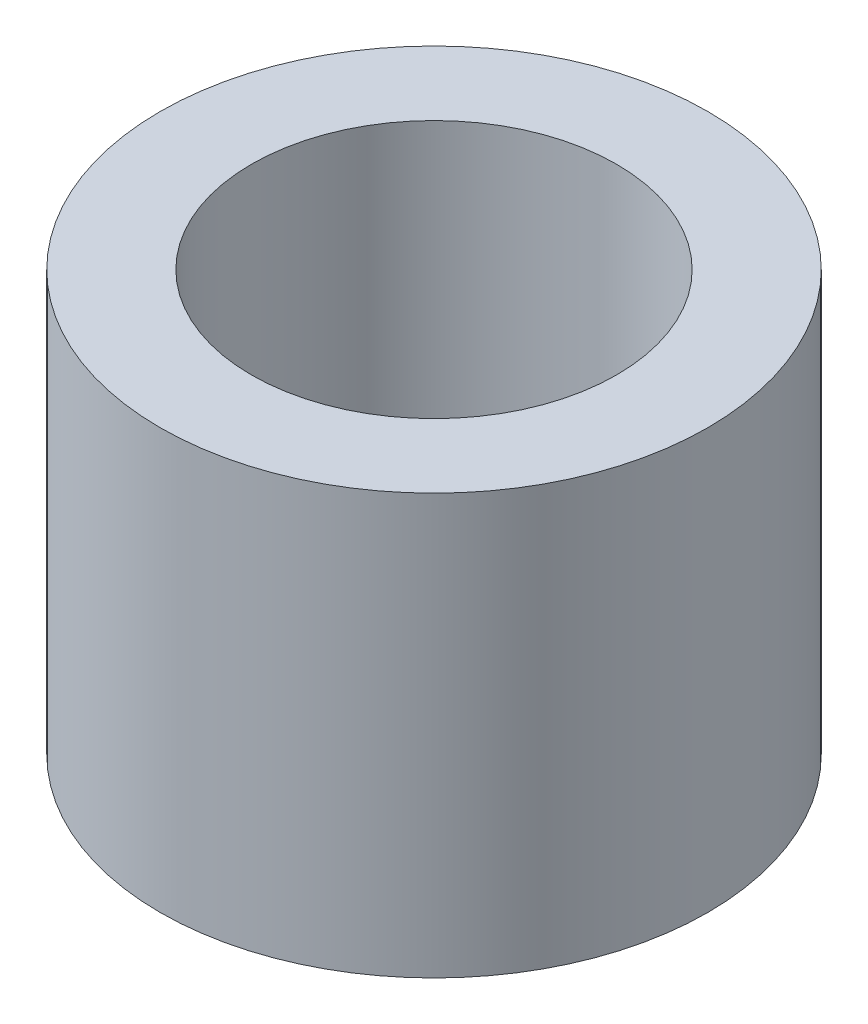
ISO-10303-21;
HEADER;
FILE_DESCRIPTION(('STEP AP214'),'2;1');
FILE_NAME('part.step','',(''),(''),'','','');
FILE_SCHEMA(('AUTOMOTIVE_DESIGN { 1 0 10303 214 1 1 1 1 }'));
ENDSEC;
DATA;
#1=APPLICATION_CONTEXT('core data for automotive mechanical design processes');
#2=APPLICATION_PROTOCOL_DEFINITION('international standard','automotive_design',2000,#1);
#3=PRODUCT_CONTEXT('',#1,'mechanical');
#4=PRODUCT('Part','Part','',(#3));
#5=PRODUCT_RELATED_PRODUCT_CATEGORY('part','',(#4));
#6=PRODUCT_DEFINITION_FORMATION('','',#4);
#7=PRODUCT_DEFINITION_CONTEXT('part definition',#1,'design');
#8=PRODUCT_DEFINITION('design','',#6,#7);
#9=PRODUCT_DEFINITION_SHAPE('','',#8);
#10=(LENGTH_UNIT() NAMED_UNIT(*) SI_UNIT(.MILLI.,.METRE.));
#11=(NAMED_UNIT(*) PLANE_ANGLE_UNIT() SI_UNIT($,.RADIAN.));
#12=(NAMED_UNIT(*) SI_UNIT($,.STERADIAN.) SOLID_ANGLE_UNIT());
#13=UNCERTAINTY_MEASURE_WITH_UNIT(LENGTH_MEASURE(1.E-05),#10,'distance_accuracy_value','');
#14=(GEOMETRIC_REPRESENTATION_CONTEXT(3) GLOBAL_UNCERTAINTY_ASSIGNED_CONTEXT((#13)) GLOBAL_UNIT_ASSIGNED_CONTEXT((#10,
#11,#12)) REPRESENTATION_CONTEXT('',''));
#15=CARTESIAN_POINT('',(0.,0.,0.));
#16=DIRECTION('',(0.,0.,1.));
#17=DIRECTION('',(1.,0.,0.));
#18=AXIS2_PLACEMENT_3D('',#15,#16,#17);
#19=CARTESIAN_POINT('',(0.,5.842,0.));
#20=DIRECTION('',(0.,-1.,0.));
#21=DIRECTION('',(0.,0.,-1.));
#22=AXIS2_PLACEMENT_3D('',#19,#20,#21);
#23=CYLINDRICAL_SURFACE('',#22,3.81);
#24=CARTESIAN_POINT('',(0.,5.842,0.));
#25=DIRECTION('',(0.,1.,0.));
#26=DIRECTION('',(0.,0.,1.));
#27=AXIS2_PLACEMENT_3D('',#24,#25,#26);
#28=CIRCLE('',#27,3.81);
#29=CARTESIAN_POINT('',(0.,5.842,3.81));
#30=VERTEX_POINT('',#29);
#31=EDGE_CURVE('E10',#30,#30,#28,.T.);
#32=ORIENTED_EDGE('',*,*,#31,.F.);
#33=EDGE_LOOP('',(#32));
#34=FACE_BOUND('',#33,.T.);
#35=CARTESIAN_POINT('',(0.,0.,0.));
#36=DIRECTION('',(0.,1.,0.));
#37=DIRECTION('',(0.,0.,1.));
#38=AXIS2_PLACEMENT_3D('',#35,#36,#37);
#39=CIRCLE('',#38,3.81);
#40=CARTESIAN_POINT('',(0.,0.,3.81));
#41=VERTEX_POINT('',#40);
#42=EDGE_CURVE('E30',#41,#41,#39,.T.);
#43=ORIENTED_EDGE('',*,*,#42,.T.);
#44=EDGE_LOOP('',(#43));
#45=FACE_BOUND('',#44,.T.);
#46=ADVANCED_FACE('F24',(#34,#45),#23,.T.);
#47=CARTESIAN_POINT('',(0.,5.842,0.));
#48=DIRECTION('',(0.,1.,0.));
#49=DIRECTION('',(0.,0.,1.));
#50=AXIS2_PLACEMENT_3D('',#47,#48,#49);
#51=PLANE('',#50);
#52=CARTESIAN_POINT('',(0.,5.842,0.));
#53=DIRECTION('',(0.,1.,0.));
#54=DIRECTION('',(0.,0.,1.));
#55=AXIS2_PLACEMENT_3D('',#52,#53,#54);
#56=CIRCLE('',#55,2.54);
#57=CARTESIAN_POINT('',(0.,5.842,2.54));
#58=VERTEX_POINT('',#57);
#59=EDGE_CURVE('E38',#58,#58,#56,.T.);
#60=ORIENTED_EDGE('',*,*,#59,.F.);
#61=EDGE_LOOP('',(#60));
#62=FACE_BOUND('',#61,.T.);
#63=ORIENTED_EDGE('',*,*,#31,.T.);
#64=EDGE_LOOP('',(#63));
#65=FACE_BOUND('',#64,.T.);
#66=ADVANCED_FACE('F46',(#62,#65),#51,.T.);
#67=CARTESIAN_POINT('',(0.,0.,0.));
#68=DIRECTION('',(0.,1.,0.));
#69=DIRECTION('',(0.,0.,1.));
#70=AXIS2_PLACEMENT_3D('',#67,#68,#69);
#71=PLANE('',#70);
#72=CARTESIAN_POINT('',(0.,0.,0.));
#73=DIRECTION('',(0.,1.,0.));
#74=DIRECTION('',(0.,0.,1.));
#75=AXIS2_PLACEMENT_3D('',#72,#73,#74);
#76=CIRCLE('',#75,2.54);
#77=CARTESIAN_POINT('',(0.,0.,2.54));
#78=VERTEX_POINT('',#77);
#79=EDGE_CURVE('E34',#78,#78,#76,.T.);
#80=ORIENTED_EDGE('',*,*,#79,.T.);
#81=EDGE_LOOP('',(#80));
#82=FACE_BOUND('',#81,.T.);
#83=ORIENTED_EDGE('',*,*,#42,.F.);
#84=EDGE_LOOP('',(#83));
#85=FACE_BOUND('',#84,.T.);
#86=ADVANCED_FACE('F48',(#82,#85),#71,.F.);
#87=CARTESIAN_POINT('',(0.,0.,0.));
#88=DIRECTION('',(0.,1.,0.));
#89=DIRECTION('',(0.,0.,1.));
#90=AXIS2_PLACEMENT_3D('',#87,#88,#89);
#91=CYLINDRICAL_SURFACE('',#90,2.54);
#92=ORIENTED_EDGE('',*,*,#79,.F.);
#93=EDGE_LOOP('',(#92));
#94=FACE_BOUND('',#93,.T.);
#95=ORIENTED_EDGE('',*,*,#59,.T.);
#96=EDGE_LOOP('',(#95));
#97=FACE_BOUND('',#96,.T.);
#98=ADVANCED_FACE('F44',(#94,#97),#91,.F.);
#99=CLOSED_SHELL('',(#46,#66,#86,#98));
#100=MANIFOLD_SOLID_BREP('B2',#99);
#101=ADVANCED_BREP_SHAPE_REPRESENTATION('',(#18,#100),#14);
#102=SHAPE_DEFINITION_REPRESENTATION(#9,#101);
ENDSEC;
END-ISO-10303-21;
